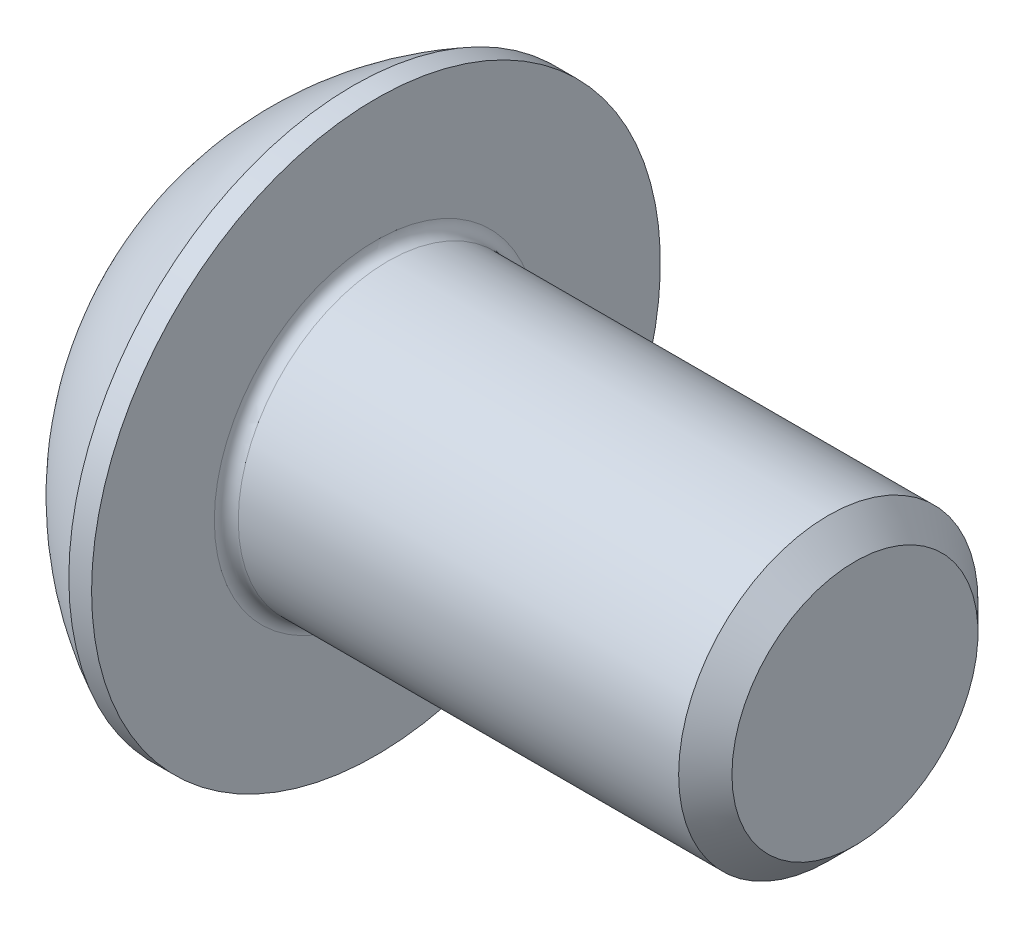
from build123d import *

# Parameters (mm, degrees)
FILLET1_R   = 0.2
HEX_2_DEPTH = 1.56


with BuildPart() as part:
    # BodySke → BaseBody (revolve)
    with BuildSketch(Plane.XY, mode=Mode.PRIVATE) as basebody_sk:
        with BuildLine():
            Line((10.75, 0), (10.75, 2.055))
            Line((10.75, 2.055), (10.305, 2.5))
            Line((10.305, 2.5), (2.75, 2.5))
            Line((2.75, 2.5), (2.75, 4.75))
            Line((2.75, 4.75), (2.37, 4.75))
            ThreePointArc((2.37, 4.75), (0.992680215, 3.754414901), (0, 2.375))
            Line((0, 2.375), (0, 0))
            Line((0, 0), (10.75, 0))
        make_face()
    revolve(basebody_sk.sketch.rotate(Axis((0, 0, 0), (1, 0, 0)), 90), axis=Axis((0, 0, 0), (1, 0, 0)))

    # Fillet1
    fillet1_edges = [part.edges().sort_by_distance(p)[0] for p in [
        (2.75, 0, -2.5),
    ]]
    fillet(fillet1_edges, radius=FILLET1_R)

    # Sketch2 → PreBroach (revolve, cut)
    with BuildSketch(Plane.XY, mode=Mode.PRIVATE) as prebroach_sk:
        Polygon((0, 1.5), (1.56, 1.5), (2.426025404, 0), (0, 0), align=None)
    revolve(prebroach_sk.sketch.rotate(Axis((0, 0, 0), (1, 0, 0)), 90), axis=Axis((0, 0, 0), (1, 0, 0)), mode=Mode.SUBTRACT)

    # Sketch3 → Hex 2 (cut)
    with BuildSketch(Plane(origin=(0, 0, 0), x_dir=(0, 0, -1), z_dir=(1, 0, 0))):
        Polygon((-1.5, -0.866025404), (-1.5, 0.866025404), (0, 1.732050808), (1.5, 0.866025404), (1.5, -0.866025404), (0, -1.732050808), align=None)
    extrude(amount=HEX_2_DEPTH, mode=Mode.SUBTRACT)


solid = part.part
